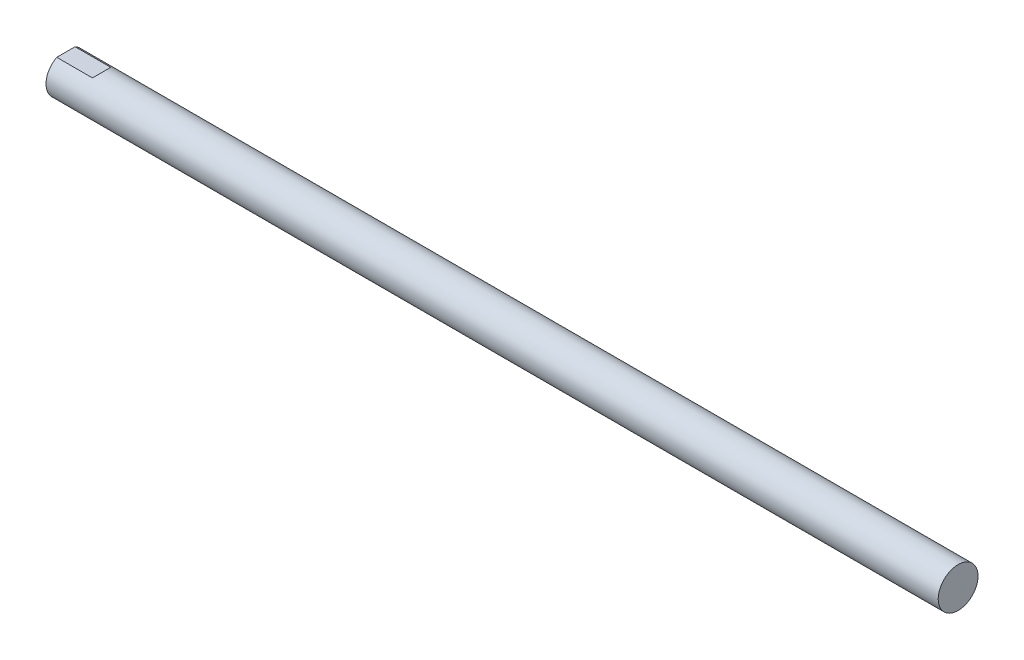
from build123d import *

# Parameters (mm, degrees)
SKETCH1_W                    = 355.6
SKETCH1_H                    = 7.9375
F_5_16_18_TAPPED_HOLE1_D     = 6.5278
F_5_16_18_TAPPED_HOLE1_DEPTH = 22.9362
F_5_16_18_TAPPED_HOLE1_TIP   = 1.961148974
CUT_EXTRUDE1_DEPTH           = 356.777132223
CUT_EXTRUDE1_DEPTH_BACK      = 356.777132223


with BuildPart() as part:
    # Sketch1 → Revolve1 (revolve)
    with BuildSketch(Plane.XY, mode=Mode.PRIVATE) as revolve1_sk:
        with Locations((177.8, 3.96875)):
            Rectangle(SKETCH1_W, SKETCH1_H)
    revolve(revolve1_sk.sketch.rotate(Axis((-29.862162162, 0, 0), (1, 0, 0)), 90), axis=Axis((-29.862162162, 0, 0), (1, 0, 0)))

    # 5_16-18 Tapped Hole1
    with Locations(Plane.ZY):
        with Locations((0, 0)):
            Hole(F_5_16_18_TAPPED_HOLE1_D / 2, depth=F_5_16_18_TAPPED_HOLE1_DEPTH)
            with Locations((0, 0, -(F_5_16_18_TAPPED_HOLE1_DEPTH + F_5_16_18_TAPPED_HOLE1_TIP / 2))):  # 118° drill point
                Cone(0, F_5_16_18_TAPPED_HOLE1_D / 2, F_5_16_18_TAPPED_HOLE1_TIP, mode=Mode.SUBTRACT)

    # Sketch4 → Cut-Extrude1 (cut, two sides: drawn at the far end of the back side and taken through both)
    with BuildSketch(Plane.XY.offset(-CUT_EXTRUDE1_DEPTH_BACK)):
        Polygon((0, 7.0485), (14.224, 7.0485), (15.113, 7.9375), (0, 7.9375), align=None)
    extrude(amount=CUT_EXTRUDE1_DEPTH + CUT_EXTRUDE1_DEPTH_BACK, mode=Mode.SUBTRACT)


solid = part.part
